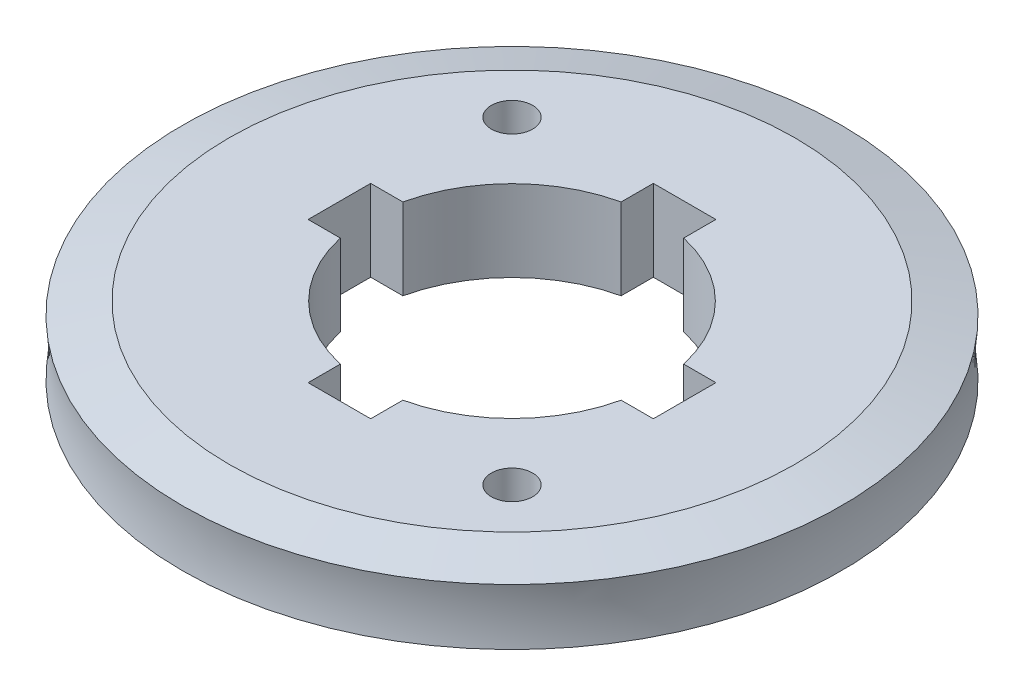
ISO-10303-21;
HEADER;
FILE_DESCRIPTION(('STEP AP214'),'2;1');
FILE_NAME('part.step','',(''),(''),'','','');
FILE_SCHEMA(('AUTOMOTIVE_DESIGN { 1 0 10303 214 1 1 1 1 }'));
ENDSEC;
DATA;
#1=APPLICATION_CONTEXT('core data for automotive mechanical design processes');
#2=APPLICATION_PROTOCOL_DEFINITION('international standard','automotive_design',2000,#1);
#3=PRODUCT_CONTEXT('',#1,'mechanical');
#4=PRODUCT('Part','Part','',(#3));
#5=PRODUCT_RELATED_PRODUCT_CATEGORY('part','',(#4));
#6=PRODUCT_DEFINITION_FORMATION('','',#4);
#7=PRODUCT_DEFINITION_CONTEXT('part definition',#1,'design');
#8=PRODUCT_DEFINITION('design','',#6,#7);
#9=PRODUCT_DEFINITION_SHAPE('','',#8);
#10=(LENGTH_UNIT() NAMED_UNIT(*) SI_UNIT(.MILLI.,.METRE.));
#11=(NAMED_UNIT(*) PLANE_ANGLE_UNIT() SI_UNIT($,.RADIAN.));
#12=(NAMED_UNIT(*) SI_UNIT($,.STERADIAN.) SOLID_ANGLE_UNIT());
#13=UNCERTAINTY_MEASURE_WITH_UNIT(LENGTH_MEASURE(1.E-05),#10,'distance_accuracy_value','');
#14=(GEOMETRIC_REPRESENTATION_CONTEXT(3) GLOBAL_UNCERTAINTY_ASSIGNED_CONTEXT((#13)) GLOBAL_UNIT_ASSIGNED_CONTEXT((#10,
#11,#12)) REPRESENTATION_CONTEXT('',''));
#15=CARTESIAN_POINT('',(0.,0.,0.));
#16=DIRECTION('',(0.,0.,1.));
#17=DIRECTION('',(1.,0.,0.));
#18=AXIS2_PLACEMENT_3D('',#15,#16,#17);
#19=CARTESIAN_POINT('',(0.,0.,0.));
#20=DIRECTION('',(0.,1.,0.));
#21=DIRECTION('',(0.,0.,1.));
#22=AXIS2_PLACEMENT_3D('',#19,#20,#21);
#23=CYLINDRICAL_SURFACE('',#22,11.5);
#24=CARTESIAN_POINT('',(0.,6.5,0.));
#25=DIRECTION('',(0.,1.,0.));
#26=DIRECTION('',(0.,0.,1.));
#27=AXIS2_PLACEMENT_3D('',#24,#25,#26);
#28=CIRCLE('',#27,11.5);
#29=CARTESIAN_POINT('',(-11.2249721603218,6.5,2.49999999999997));
#30=VERTEX_POINT('',#29);
#31=CARTESIAN_POINT('',(-2.5,6.5,11.2249721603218));
#32=VERTEX_POINT('',#31);
#33=EDGE_CURVE('E283',#30,#32,#28,.T.);
#34=ORIENTED_EDGE('',*,*,#33,.T.);
#35=DIRECTION('',(0.,1.,0.));
#36=VECTOR('',#35,1.);
#37=CARTESIAN_POINT('',(-2.5,0.,11.2249721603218));
#38=LINE('',#37,#36);
#39=CARTESIAN_POINT('',(-2.5,0.,11.2249721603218));
#40=VERTEX_POINT('',#39);
#41=EDGE_CURVE('E171',#40,#32,#38,.T.);
#42=ORIENTED_EDGE('',*,*,#41,.F.);
#43=CARTESIAN_POINT('',(0.,0.,0.));
#44=DIRECTION('',(0.,1.,0.));
#45=DIRECTION('',(0.,0.,1.));
#46=AXIS2_PLACEMENT_3D('',#43,#44,#45);
#47=CIRCLE('',#46,11.5);
#48=CARTESIAN_POINT('',(-11.2249721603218,0.,2.5));
#49=VERTEX_POINT('',#48);
#50=EDGE_CURVE('E289',#49,#40,#47,.T.);
#51=ORIENTED_EDGE('',*,*,#50,.F.);
#52=DIRECTION('',(0.,1.,0.));
#53=VECTOR('',#52,1.);
#54=CARTESIAN_POINT('',(-11.2249721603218,0.,2.5));
#55=LINE('',#54,#53);
#56=EDGE_CURVE('E239',#49,#30,#55,.T.);
#57=ORIENTED_EDGE('',*,*,#56,.T.);
#58=EDGE_LOOP('',(#34,#42,#51,#57));
#59=FACE_BOUND('',#58,.T.);
#60=ADVANCED_FACE('F41',(#59),#23,.F.);
#61=CARTESIAN_POINT('',(11.2249721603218,6.5,-2.49999999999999));
#62=VERTEX_POINT('',#61);
#63=CARTESIAN_POINT('',(2.49999999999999,6.5,-11.2249721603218));
#64=VERTEX_POINT('',#63);
#65=EDGE_CURVE('E277',#62,#64,#28,.T.);
#66=ORIENTED_EDGE('',*,*,#65,.T.);
#67=DIRECTION('',(0.,1.,0.));
#68=VECTOR('',#67,1.);
#69=CARTESIAN_POINT('',(2.49999999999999,0.,-11.2249721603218));
#70=LINE('',#69,#68);
#71=CARTESIAN_POINT('',(2.49999999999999,0.,-11.2249721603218));
#72=VERTEX_POINT('',#71);
#73=EDGE_CURVE('E212',#72,#64,#70,.T.);
#74=ORIENTED_EDGE('',*,*,#73,.F.);
#75=CARTESIAN_POINT('',(11.2249721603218,0.,-2.5));
#76=VERTEX_POINT('',#75);
#77=EDGE_CURVE('E284',#76,#72,#47,.T.);
#78=ORIENTED_EDGE('',*,*,#77,.F.);
#79=DIRECTION('',(0.,1.,0.));
#80=VECTOR('',#79,1.);
#81=CARTESIAN_POINT('',(11.2249721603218,0.,-2.5));
#82=LINE('',#81,#80);
#83=EDGE_CURVE('E268',#76,#62,#82,.T.);
#84=ORIENTED_EDGE('',*,*,#83,.T.);
#85=EDGE_LOOP('',(#66,#74,#78,#84));
#86=FACE_BOUND('',#85,.T.);
#87=ADVANCED_FACE('F312',(#86),#23,.F.);
#88=CARTESIAN_POINT('',(-2.50000000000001,0.,-11.2249721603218));
#89=VERTEX_POINT('',#88);
#90=CARTESIAN_POINT('',(-11.2249721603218,0.,-2.5));
#91=VERTEX_POINT('',#90);
#92=EDGE_CURVE('E288',#89,#91,#47,.T.);
#93=ORIENTED_EDGE('',*,*,#92,.F.);
#94=DIRECTION('',(0.,1.,0.));
#95=VECTOR('',#94,1.);
#96=CARTESIAN_POINT('',(-2.50000000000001,0.,-11.2249721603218));
#97=LINE('',#96,#95);
#98=CARTESIAN_POINT('',(-2.50000000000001,6.5,-11.2249721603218));
#99=VERTEX_POINT('',#98);
#100=EDGE_CURVE('E214',#89,#99,#97,.T.);
#101=ORIENTED_EDGE('',*,*,#100,.T.);
#102=CARTESIAN_POINT('',(-11.2249721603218,6.5,-2.5));
#103=VERTEX_POINT('',#102);
#104=EDGE_CURVE('E281',#99,#103,#28,.T.);
#105=ORIENTED_EDGE('',*,*,#104,.T.);
#106=DIRECTION('',(0.,1.,0.));
#107=VECTOR('',#106,1.);
#108=CARTESIAN_POINT('',(-11.2249721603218,0.,-2.5));
#109=LINE('',#108,#107);
#110=EDGE_CURVE('E235',#91,#103,#109,.T.);
#111=ORIENTED_EDGE('',*,*,#110,.F.);
#112=EDGE_LOOP('',(#93,#101,#105,#111));
#113=FACE_BOUND('',#112,.T.);
#114=ADVANCED_FACE('F318',(#113),#23,.F.);
#115=CARTESIAN_POINT('',(3.,0.,0.));
#116=DIRECTION('',(0.,-1.,0.));
#117=DIRECTION('',(0.,0.,-1.));
#118=AXIS2_PLACEMENT_3D('',#115,#116,#117);
#119=PLANE('',#118);
#120=DIRECTION('',(0.,0.,1.));
#121=VECTOR('',#120,1.);
#122=CARTESIAN_POINT('',(-2.5,0.,13.8));
#123=LINE('',#122,#121);
#124=CARTESIAN_POINT('',(-2.5,0.,13.8));
#125=VERTEX_POINT('',#124);
#126=EDGE_CURVE('E181',#40,#125,#123,.T.);
#127=ORIENTED_EDGE('',*,*,#126,.T.);
#128=DIRECTION('',(1.,0.,0.));
#129=VECTOR('',#128,1.);
#130=CARTESIAN_POINT('',(-2.5,0.,13.8));
#131=LINE('',#130,#129);
#132=CARTESIAN_POINT('',(2.5,0.,13.8));
#133=VERTEX_POINT('',#132);
#134=EDGE_CURVE('E161',#125,#133,#131,.T.);
#135=ORIENTED_EDGE('',*,*,#134,.T.);
#136=DIRECTION('',(0.,0.,-1.));
#137=VECTOR('',#136,1.);
#138=CARTESIAN_POINT('',(2.5,0.,13.8));
#139=LINE('',#138,#137);
#140=CARTESIAN_POINT('',(2.5,0.,11.2249721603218));
#141=VERTEX_POINT('',#140);
#142=EDGE_CURVE('E165',#133,#141,#139,.T.);
#143=ORIENTED_EDGE('',*,*,#142,.T.);
#144=CARTESIAN_POINT('',(11.2249721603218,0.,2.5));
#145=VERTEX_POINT('',#144);
#146=EDGE_CURVE('E280',#141,#145,#47,.T.);
#147=ORIENTED_EDGE('',*,*,#146,.T.);
#148=DIRECTION('',(1.,0.,0.));
#149=VECTOR('',#148,1.);
#150=CARTESIAN_POINT('',(13.8,0.,2.5));
#151=LINE('',#150,#149);
#152=CARTESIAN_POINT('',(13.8,0.,2.5));
#153=VERTEX_POINT('',#152);
#154=EDGE_CURVE('E258',#145,#153,#151,.T.);
#155=ORIENTED_EDGE('',*,*,#154,.T.);
#156=DIRECTION('',(0.,0.,-1.));
#157=VECTOR('',#156,1.);
#158=CARTESIAN_POINT('',(13.8,0.,-2.5));
#159=LINE('',#158,#157);
#160=CARTESIAN_POINT('',(13.8,0.,-2.5));
#161=VERTEX_POINT('',#160);
#162=EDGE_CURVE('E252',#153,#161,#159,.T.);
#163=ORIENTED_EDGE('',*,*,#162,.T.);
#164=DIRECTION('',(-1.,0.,0.));
#165=VECTOR('',#164,1.);
#166=CARTESIAN_POINT('',(13.8,0.,-2.5));
#167=LINE('',#166,#165);
#168=EDGE_CURVE('E255',#161,#76,#167,.T.);
#169=ORIENTED_EDGE('',*,*,#168,.T.);
#170=ORIENTED_EDGE('',*,*,#77,.T.);
#171=DIRECTION('',(0.,0.,-1.));
#172=VECTOR('',#171,1.);
#173=CARTESIAN_POINT('',(2.49999999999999,0.,-13.8));
#174=LINE('',#173,#172);
#175=CARTESIAN_POINT('',(2.49999999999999,0.,-13.8));
#176=VERTEX_POINT('',#175);
#177=EDGE_CURVE('E205',#72,#176,#174,.T.);
#178=ORIENTED_EDGE('',*,*,#177,.T.);
#179=DIRECTION('',(-1.,0.,0.));
#180=VECTOR('',#179,1.);
#181=CARTESIAN_POINT('',(-2.50000000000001,0.,-13.8));
#182=LINE('',#181,#180);
#183=CARTESIAN_POINT('',(-2.50000000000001,0.,-13.8));
#184=VERTEX_POINT('',#183);
#185=EDGE_CURVE('E199',#176,#184,#182,.T.);
#186=ORIENTED_EDGE('',*,*,#185,.T.);
#187=DIRECTION('',(0.,0.,1.));
#188=VECTOR('',#187,1.);
#189=CARTESIAN_POINT('',(-2.50000000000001,0.,-13.8));
#190=LINE('',#189,#188);
#191=EDGE_CURVE('E202',#184,#89,#190,.T.);
#192=ORIENTED_EDGE('',*,*,#191,.T.);
#193=ORIENTED_EDGE('',*,*,#92,.T.);
#194=DIRECTION('',(-1.,0.,0.));
#195=VECTOR('',#194,1.);
#196=CARTESIAN_POINT('',(-13.8,0.,-2.5));
#197=LINE('',#196,#195);
#198=CARTESIAN_POINT('',(-13.8,0.,-2.5));
#199=VERTEX_POINT('',#198);
#200=EDGE_CURVE('E225',#91,#199,#197,.T.);
#201=ORIENTED_EDGE('',*,*,#200,.T.);
#202=DIRECTION('',(0.,0.,1.));
#203=VECTOR('',#202,1.);
#204=CARTESIAN_POINT('',(-13.8,0.,-2.5));
#205=LINE('',#204,#203);
#206=CARTESIAN_POINT('',(-13.8,0.,2.5));
#207=VERTEX_POINT('',#206);
#208=EDGE_CURVE('E228',#199,#207,#205,.T.);
#209=ORIENTED_EDGE('',*,*,#208,.T.);
#210=DIRECTION('',(1.,0.,0.));
#211=VECTOR('',#210,1.);
#212=CARTESIAN_POINT('',(-13.8,0.,2.5));
#213=LINE('',#212,#211);
#214=EDGE_CURVE('E231',#207,#49,#213,.T.);
#215=ORIENTED_EDGE('',*,*,#214,.T.);
#216=ORIENTED_EDGE('',*,*,#50,.T.);
#217=EDGE_LOOP('',(#127,#135,#143,#147,#155,#163,#169,#170,#178,#186,#192,#193,#201,#209,#215,#216));
#218=FACE_BOUND('',#217,.T.);
#219=CARTESIAN_POINT('',(0.,0.,0.));
#220=DIRECTION('',(0.,-1.,0.));
#221=DIRECTION('',(0.,0.,-1.));
#222=AXIS2_PLACEMENT_3D('',#219,#220,#221);
#223=CIRCLE('',#222,14.25);
#224=CARTESIAN_POINT('',(0.,0.,-14.25));
#225=VERTEX_POINT('',#224);
#226=EDGE_CURVE('E264',#225,#225,#223,.T.);
#227=ORIENTED_EDGE('',*,*,#226,.T.);
#228=EDGE_LOOP('',(#227));
#229=FACE_BOUND('',#228,.T.);
#230=ADVANCED_FACE('F43',(#218,#229),#119,.T.);
#231=CARTESIAN_POINT('',(0.,0.,0.));
#232=DIRECTION('',(0.,1.,0.));
#233=DIRECTION('',(0.,0.,1.));
#234=AXIS2_PLACEMENT_3D('',#231,#232,#233);
#235=CONICAL_SURFACE('',#234,22.6179491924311,1.30899693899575);
#236=CARTESIAN_POINT('',(0.,0.999999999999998,0.));
#237=DIRECTION('',(0.,-1.,0.));
#238=DIRECTION('',(0.,0.,-1.));
#239=AXIS2_PLACEMENT_3D('',#236,#237,#238);
#240=CIRCLE('',#239,26.35);
#241=CARTESIAN_POINT('',(0.,0.999999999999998,-26.35));
#242=VERTEX_POINT('',#241);
#243=EDGE_CURVE('E12',#242,#242,#240,.T.);
#244=ORIENTED_EDGE('',*,*,#243,.T.);
#245=EDGE_LOOP('',(#244));
#246=FACE_BOUND('',#245,.T.);
#247=CARTESIAN_POINT('',(0.,0.3,0.));
#248=DIRECTION('',(0.,-1.,0.));
#249=DIRECTION('',(0.,0.,-1.));
#250=AXIS2_PLACEMENT_3D('',#247,#248,#249);
#251=CIRCLE('',#250,23.7375644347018);
#252=CARTESIAN_POINT('',(0.,0.3,-23.7375644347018));
#253=VERTEX_POINT('',#252);
#254=EDGE_CURVE('E45',#253,#253,#251,.F.);
#255=ORIENTED_EDGE('',*,*,#254,.T.);
#256=EDGE_LOOP('',(#255));
#257=FACE_BOUND('',#256,.T.);
#258=ADVANCED_FACE('F309',(#246,#257),#235,.T.);
#259=CARTESIAN_POINT('',(0.,3.25,0.));
#260=DIRECTION('',(0.,-1.,0.));
#261=DIRECTION('',(0.,0.,-1.));
#262=AXIS2_PLACEMENT_3D('',#259,#260,#261);
#263=TOROIDAL_SURFACE('',#262,42.1910069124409,16.);
#264=CARTESIAN_POINT('',(0.,5.49999999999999,0.));
#265=DIRECTION('',(0.,-1.,0.));
#266=DIRECTION('',(0.,0.,-1.));
#267=AXIS2_PLACEMENT_3D('',#264,#265,#266);
#268=CIRCLE('',#267,26.35);
#269=CARTESIAN_POINT('',(0.,5.49999999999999,-26.35));
#270=VERTEX_POINT('',#269);
#271=EDGE_CURVE('E50',#270,#270,#268,.T.);
#272=ORIENTED_EDGE('',*,*,#271,.T.);
#273=EDGE_LOOP('',(#272));
#274=FACE_BOUND('',#273,.T.);
#275=ORIENTED_EDGE('',*,*,#243,.F.);
#276=EDGE_LOOP('',(#275));
#277=FACE_BOUND('',#276,.T.);
#278=ADVANCED_FACE('F295',(#274,#277),#263,.F.);
#279=CARTESIAN_POINT('',(0.,5.49999999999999,0.));
#280=DIRECTION('',(0.,-1.,0.));
#281=DIRECTION('',(0.,0.,-1.));
#282=AXIS2_PLACEMENT_3D('',#279,#280,#281);
#283=CONICAL_SURFACE('',#282,26.35,1.30899693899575);
#284=CARTESIAN_POINT('',(0.,6.5,0.));
#285=DIRECTION('',(0.,-1.,0.));
#286=DIRECTION('',(0.,0.,-1.));
#287=AXIS2_PLACEMENT_3D('',#284,#285,#286);
#288=CIRCLE('',#287,22.6179491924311);
#289=CARTESIAN_POINT('',(0.,6.5,-22.6179491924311));
#290=VERTEX_POINT('',#289);
#291=EDGE_CURVE('E287',#290,#290,#288,.T.);
#292=ORIENTED_EDGE('',*,*,#291,.T.);
#293=EDGE_LOOP('',(#292));
#294=FACE_BOUND('',#293,.T.);
#295=ORIENTED_EDGE('',*,*,#271,.F.);
#296=EDGE_LOOP('',(#295));
#297=FACE_BOUND('',#296,.T.);
#298=ADVANCED_FACE('F298',(#294,#297),#283,.T.);
#299=CARTESIAN_POINT('',(22.6179491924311,6.5,0.));
#300=DIRECTION('',(0.,1.,0.));
#301=DIRECTION('',(0.,0.,1.));
#302=AXIS2_PLACEMENT_3D('',#299,#300,#301);
#303=PLANE('',#302);
#304=CARTESIAN_POINT('',(-12.7279220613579,6.5,-12.7279220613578));
#305=DIRECTION('',(0.,-1.,0.));
#306=DIRECTION('',(0.,0.,-1.));
#307=AXIS2_PLACEMENT_3D('',#304,#305,#306);
#308=CIRCLE('',#307,1.65);
#309=CARTESIAN_POINT('',(-12.7279220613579,6.5,-14.3779220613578));
#310=VERTEX_POINT('',#309);
#311=EDGE_CURVE('E517',#310,#310,#308,.T.);
#312=ORIENTED_EDGE('',*,*,#311,.T.);
#313=EDGE_LOOP('',(#312));
#314=FACE_BOUND('',#313,.T.);
#315=CARTESIAN_POINT('',(12.7279220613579,6.5,12.7279220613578));
#316=DIRECTION('',(0.,-1.,0.));
#317=DIRECTION('',(0.,0.,-1.));
#318=AXIS2_PLACEMENT_3D('',#315,#316,#317);
#319=CIRCLE('',#318,1.65);
#320=CARTESIAN_POINT('',(12.7279220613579,6.5,11.0779220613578));
#321=VERTEX_POINT('',#320);
#322=EDGE_CURVE('E175',#321,#321,#319,.T.);
#323=ORIENTED_EDGE('',*,*,#322,.T.);
#324=EDGE_LOOP('',(#323));
#325=FACE_BOUND('',#324,.T.);
#326=DIRECTION('',(0.,0.,1.));
#327=VECTOR('',#326,1.);
#328=CARTESIAN_POINT('',(-2.5,6.5,13.8));
#329=LINE('',#328,#327);
#330=CARTESIAN_POINT('',(-2.5,6.5,13.8));
#331=VERTEX_POINT('',#330);
#332=EDGE_CURVE('E168',#32,#331,#329,.T.);
#333=ORIENTED_EDGE('',*,*,#332,.F.);
#334=ORIENTED_EDGE('',*,*,#33,.F.);
#335=DIRECTION('',(1.,0.,0.));
#336=VECTOR('',#335,1.);
#337=CARTESIAN_POINT('',(-13.8,6.5,2.5));
#338=LINE('',#337,#336);
#339=CARTESIAN_POINT('',(-13.8,6.5,2.5));
#340=VERTEX_POINT('',#339);
#341=EDGE_CURVE('E223',#340,#30,#338,.T.);
#342=ORIENTED_EDGE('',*,*,#341,.F.);
#343=DIRECTION('',(0.,0.,1.));
#344=VECTOR('',#343,1.);
#345=CARTESIAN_POINT('',(-13.8,6.5,-2.5));
#346=LINE('',#345,#344);
#347=CARTESIAN_POINT('',(-13.8,6.5,-2.5));
#348=VERTEX_POINT('',#347);
#349=EDGE_CURVE('E220',#348,#340,#346,.T.);
#350=ORIENTED_EDGE('',*,*,#349,.F.);
#351=DIRECTION('',(-1.,0.,0.));
#352=VECTOR('',#351,1.);
#353=CARTESIAN_POINT('',(-13.8,6.5,-2.5));
#354=LINE('',#353,#352);
#355=EDGE_CURVE('E211',#103,#348,#354,.T.);
#356=ORIENTED_EDGE('',*,*,#355,.F.);
#357=ORIENTED_EDGE('',*,*,#104,.F.);
#358=DIRECTION('',(0.,0.,1.));
#359=VECTOR('',#358,1.);
#360=CARTESIAN_POINT('',(-2.50000000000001,6.5,-13.8));
#361=LINE('',#360,#359);
#362=CARTESIAN_POINT('',(-2.5,6.5,-13.8));
#363=VERTEX_POINT('',#362);
#364=EDGE_CURVE('E194',#363,#99,#361,.T.);
#365=ORIENTED_EDGE('',*,*,#364,.F.);
#366=DIRECTION('',(-1.,0.,0.));
#367=VECTOR('',#366,1.);
#368=CARTESIAN_POINT('',(-2.50000000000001,6.5,-13.8));
#369=LINE('',#368,#367);
#370=CARTESIAN_POINT('',(2.49999999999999,6.5,-13.8));
#371=VERTEX_POINT('',#370);
#372=EDGE_CURVE('E65',#371,#363,#369,.T.);
#373=ORIENTED_EDGE('',*,*,#372,.F.);
#374=DIRECTION('',(0.,0.,-1.));
#375=VECTOR('',#374,1.);
#376=CARTESIAN_POINT('',(2.49999999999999,6.5,-13.8));
#377=LINE('',#376,#375);
#378=EDGE_CURVE('E196',#64,#371,#377,.T.);
#379=ORIENTED_EDGE('',*,*,#378,.F.);
#380=ORIENTED_EDGE('',*,*,#65,.F.);
#381=DIRECTION('',(-1.,0.,0.));
#382=VECTOR('',#381,1.);
#383=CARTESIAN_POINT('',(13.8,6.5,-2.5));
#384=LINE('',#383,#382);
#385=CARTESIAN_POINT('',(13.8,6.5,-2.5));
#386=VERTEX_POINT('',#385);
#387=EDGE_CURVE('E247',#386,#62,#384,.T.);
#388=ORIENTED_EDGE('',*,*,#387,.F.);
#389=DIRECTION('',(0.,0.,-1.));
#390=VECTOR('',#389,1.);
#391=CARTESIAN_POINT('',(13.8,6.5,-2.5));
#392=LINE('',#391,#390);
#393=CARTESIAN_POINT('',(13.8,6.5,2.5));
#394=VERTEX_POINT('',#393);
#395=EDGE_CURVE('E238',#394,#386,#392,.T.);
#396=ORIENTED_EDGE('',*,*,#395,.F.);
#397=DIRECTION('',(1.,0.,0.));
#398=VECTOR('',#397,1.);
#399=CARTESIAN_POINT('',(13.8,6.5,2.5));
#400=LINE('',#399,#398);
#401=CARTESIAN_POINT('',(11.2249721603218,6.5,2.5));
#402=VERTEX_POINT('',#401);
#403=EDGE_CURVE('E249',#402,#394,#400,.T.);
#404=ORIENTED_EDGE('',*,*,#403,.F.);
#405=CARTESIAN_POINT('',(2.49999999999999,6.5,11.2249721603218));
#406=VERTEX_POINT('',#405);
#407=EDGE_CURVE('E282',#406,#402,#28,.T.);
#408=ORIENTED_EDGE('',*,*,#407,.F.);
#409=DIRECTION('',(0.,0.,-1.));
#410=VECTOR('',#409,1.);
#411=CARTESIAN_POINT('',(2.5,6.5,13.8));
#412=LINE('',#411,#410);
#413=CARTESIAN_POINT('',(2.5,6.5,13.8));
#414=VERTEX_POINT('',#413);
#415=EDGE_CURVE('E57',#414,#406,#412,.T.);
#416=ORIENTED_EDGE('',*,*,#415,.F.);
#417=DIRECTION('',(1.,0.,0.));
#418=VECTOR('',#417,1.);
#419=CARTESIAN_POINT('',(-2.5,6.5,13.8));
#420=LINE('',#419,#418);
#421=EDGE_CURVE('E159',#331,#414,#420,.T.);
#422=ORIENTED_EDGE('',*,*,#421,.F.);
#423=EDGE_LOOP('',(#333,#334,#342,#350,#356,#357,#365,#373,#379,#380,#388,#396,#404,#408,#416,#422));
#424=FACE_BOUND('',#423,.T.);
#425=ORIENTED_EDGE('',*,*,#291,.F.);
#426=EDGE_LOOP('',(#425));
#427=FACE_BOUND('',#426,.T.);
#428=ADVANCED_FACE('F177',(#314,#325,#424,#427),#303,.T.);
#429=ORIENTED_EDGE('',*,*,#146,.F.);
#430=DIRECTION('',(0.,1.,0.));
#431=VECTOR('',#430,1.);
#432=CARTESIAN_POINT('',(2.5,0.,11.2249721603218));
#433=LINE('',#432,#431);
#434=EDGE_CURVE('E190',#141,#406,#433,.T.);
#435=ORIENTED_EDGE('',*,*,#434,.T.);
#436=ORIENTED_EDGE('',*,*,#407,.T.);
#437=DIRECTION('',(0.,1.,0.));
#438=VECTOR('',#437,1.);
#439=CARTESIAN_POINT('',(11.2249721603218,0.,2.5));
#440=LINE('',#439,#438);
#441=EDGE_CURVE('E265',#145,#402,#440,.T.);
#442=ORIENTED_EDGE('',*,*,#441,.F.);
#443=EDGE_LOOP('',(#429,#435,#436,#442));
#444=FACE_BOUND('',#443,.T.);
#445=ADVANCED_FACE('F306',(#444),#23,.F.);
#446=CARTESIAN_POINT('',(0.,0.3,0.));
#447=DIRECTION('',(0.,-1.,0.));
#448=DIRECTION('',(0.,0.,-1.));
#449=AXIS2_PLACEMENT_3D('',#446,#447,#448);
#450=PLANE('',#449);
#451=CARTESIAN_POINT('',(-12.7279220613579,0.3,-12.7279220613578));
#452=DIRECTION('',(0.,-1.,0.));
#453=DIRECTION('',(0.,0.,-1.));
#454=AXIS2_PLACEMENT_3D('',#451,#452,#453);
#455=CIRCLE('',#454,1.65);
#456=CARTESIAN_POINT('',(-12.7279220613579,0.3,-14.3779220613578));
#457=VERTEX_POINT('',#456);
#458=EDGE_CURVE('E520',#457,#457,#455,.T.);
#459=ORIENTED_EDGE('',*,*,#458,.F.);
#460=EDGE_LOOP('',(#459));
#461=FACE_BOUND('',#460,.T.);
#462=CARTESIAN_POINT('',(12.7279220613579,0.3,12.7279220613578));
#463=DIRECTION('',(0.,-1.,0.));
#464=DIRECTION('',(0.,0.,-1.));
#465=AXIS2_PLACEMENT_3D('',#462,#463,#464);
#466=CIRCLE('',#465,1.65);
#467=CARTESIAN_POINT('',(12.7279220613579,0.3,11.0779220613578));
#468=VERTEX_POINT('',#467);
#469=EDGE_CURVE('E522',#468,#468,#466,.T.);
#470=ORIENTED_EDGE('',*,*,#469,.F.);
#471=EDGE_LOOP('',(#470));
#472=FACE_BOUND('',#471,.T.);
#473=ORIENTED_EDGE('',*,*,#254,.F.);
#474=EDGE_LOOP('',(#473));
#475=FACE_BOUND('',#474,.T.);
#476=CARTESIAN_POINT('',(0.,0.3,0.));
#477=DIRECTION('',(0.,-1.,0.));
#478=DIRECTION('',(0.,0.,-1.));
#479=AXIS2_PLACEMENT_3D('',#476,#477,#478);
#480=CIRCLE('',#479,14.25);
#481=CARTESIAN_POINT('',(0.,0.3,-14.25));
#482=VERTEX_POINT('',#481);
#483=EDGE_CURVE('E274',#482,#482,#480,.T.);
#484=ORIENTED_EDGE('',*,*,#483,.F.);
#485=EDGE_LOOP('',(#484));
#486=FACE_BOUND('',#485,.T.);
#487=ADVANCED_FACE('F322',(#461,#472,#475,#486),#450,.T.);
#488=CARTESIAN_POINT('',(0.,0.3,0.));
#489=DIRECTION('',(0.,-1.,0.));
#490=DIRECTION('',(0.,0.,-1.));
#491=AXIS2_PLACEMENT_3D('',#488,#489,#490);
#492=CYLINDRICAL_SURFACE('',#491,14.25);
#493=ORIENTED_EDGE('',*,*,#483,.T.);
#494=EDGE_LOOP('',(#493));
#495=FACE_BOUND('',#494,.T.);
#496=ORIENTED_EDGE('',*,*,#226,.F.);
#497=EDGE_LOOP('',(#496));
#498=FACE_BOUND('',#497,.T.);
#499=ADVANCED_FACE('F327',(#495,#498),#492,.T.);
#500=CARTESIAN_POINT('',(13.8,0.,-2.5));
#501=DIRECTION('',(1.,0.,0.));
#502=DIRECTION('',(0.,0.,-1.));
#503=AXIS2_PLACEMENT_3D('',#500,#501,#502);
#504=PLANE('',#503);
#505=ORIENTED_EDGE('',*,*,#395,.T.);
#506=DIRECTION('',(0.,1.,0.));
#507=VECTOR('',#506,1.);
#508=CARTESIAN_POINT('',(13.8,0.,-2.5));
#509=LINE('',#508,#507);
#510=EDGE_CURVE('E261',#161,#386,#509,.T.);
#511=ORIENTED_EDGE('',*,*,#510,.F.);
#512=ORIENTED_EDGE('',*,*,#162,.F.);
#513=DIRECTION('',(0.,1.,0.));
#514=VECTOR('',#513,1.);
#515=CARTESIAN_POINT('',(13.8,0.,2.5));
#516=LINE('',#515,#514);
#517=EDGE_CURVE('E262',#153,#394,#516,.T.);
#518=ORIENTED_EDGE('',*,*,#517,.T.);
#519=EDGE_LOOP('',(#505,#511,#512,#518));
#520=FACE_BOUND('',#519,.T.);
#521=ADVANCED_FACE('F378',(#520),#504,.F.);
#522=CARTESIAN_POINT('',(13.8,0.,2.5));
#523=DIRECTION('',(0.,0.,1.));
#524=DIRECTION('',(1.,0.,0.));
#525=AXIS2_PLACEMENT_3D('',#522,#523,#524);
#526=PLANE('',#525);
#527=ORIENTED_EDGE('',*,*,#403,.T.);
#528=ORIENTED_EDGE('',*,*,#517,.F.);
#529=ORIENTED_EDGE('',*,*,#154,.F.);
#530=ORIENTED_EDGE('',*,*,#441,.T.);
#531=EDGE_LOOP('',(#527,#528,#529,#530));
#532=FACE_BOUND('',#531,.T.);
#533=ADVANCED_FACE('F346',(#532),#526,.F.);
#534=CARTESIAN_POINT('',(13.8,0.,-2.5));
#535=DIRECTION('',(0.,0.,-1.));
#536=DIRECTION('',(-1.,0.,0.));
#537=AXIS2_PLACEMENT_3D('',#534,#535,#536);
#538=PLANE('',#537);
#539=ORIENTED_EDGE('',*,*,#387,.T.);
#540=ORIENTED_EDGE('',*,*,#83,.F.);
#541=ORIENTED_EDGE('',*,*,#168,.F.);
#542=ORIENTED_EDGE('',*,*,#510,.T.);
#543=EDGE_LOOP('',(#539,#540,#541,#542));
#544=FACE_BOUND('',#543,.T.);
#545=ADVANCED_FACE('F371',(#544),#538,.F.);
#546=CARTESIAN_POINT('',(-13.8,0.,-2.5));
#547=DIRECTION('',(0.,0.,-1.));
#548=DIRECTION('',(-1.,0.,0.));
#549=AXIS2_PLACEMENT_3D('',#546,#547,#548);
#550=PLANE('',#549);
#551=ORIENTED_EDGE('',*,*,#355,.T.);
#552=DIRECTION('',(0.,1.,0.));
#553=VECTOR('',#552,1.);
#554=CARTESIAN_POINT('',(-13.8,0.,-2.5));
#555=LINE('',#554,#553);
#556=EDGE_CURVE('E234',#199,#348,#555,.T.);
#557=ORIENTED_EDGE('',*,*,#556,.F.);
#558=ORIENTED_EDGE('',*,*,#200,.F.);
#559=ORIENTED_EDGE('',*,*,#110,.T.);
#560=EDGE_LOOP('',(#551,#557,#558,#559));
#561=FACE_BOUND('',#560,.T.);
#562=ADVANCED_FACE('F353',(#561),#550,.F.);
#563=CARTESIAN_POINT('',(-13.8,0.,2.5));
#564=DIRECTION('',(0.,0.,1.));
#565=DIRECTION('',(1.,0.,0.));
#566=AXIS2_PLACEMENT_3D('',#563,#564,#565);
#567=PLANE('',#566);
#568=ORIENTED_EDGE('',*,*,#341,.T.);
#569=ORIENTED_EDGE('',*,*,#56,.F.);
#570=ORIENTED_EDGE('',*,*,#214,.F.);
#571=DIRECTION('',(0.,1.,0.));
#572=VECTOR('',#571,1.);
#573=CARTESIAN_POINT('',(-13.8,0.,2.5));
#574=LINE('',#573,#572);
#575=EDGE_CURVE('E242',#207,#340,#574,.T.);
#576=ORIENTED_EDGE('',*,*,#575,.T.);
#577=EDGE_LOOP('',(#568,#569,#570,#576));
#578=FACE_BOUND('',#577,.T.);
#579=ADVANCED_FACE('F362',(#578),#567,.F.);
#580=CARTESIAN_POINT('',(-13.8,0.,-2.5));
#581=DIRECTION('',(-1.,0.,0.));
#582=DIRECTION('',(0.,0.,1.));
#583=AXIS2_PLACEMENT_3D('',#580,#581,#582);
#584=PLANE('',#583);
#585=ORIENTED_EDGE('',*,*,#349,.T.);
#586=ORIENTED_EDGE('',*,*,#575,.F.);
#587=ORIENTED_EDGE('',*,*,#208,.F.);
#588=ORIENTED_EDGE('',*,*,#556,.T.);
#589=EDGE_LOOP('',(#585,#586,#587,#588));
#590=FACE_BOUND('',#589,.T.);
#591=ADVANCED_FACE('F357',(#590),#584,.F.);
#592=CARTESIAN_POINT('',(-2.50000000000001,0.,-13.8));
#593=DIRECTION('',(0.,0.,-1.));
#594=DIRECTION('',(-1.,0.,0.));
#595=AXIS2_PLACEMENT_3D('',#592,#593,#594);
#596=PLANE('',#595);
#597=ORIENTED_EDGE('',*,*,#372,.T.);
#598=DIRECTION('',(0.,1.,0.));
#599=VECTOR('',#598,1.);
#600=CARTESIAN_POINT('',(-2.50000000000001,0.,-13.8));
#601=LINE('',#600,#599);
#602=EDGE_CURVE('E208',#184,#363,#601,.T.);
#603=ORIENTED_EDGE('',*,*,#602,.F.);
#604=ORIENTED_EDGE('',*,*,#185,.F.);
#605=DIRECTION('',(0.,1.,0.));
#606=VECTOR('',#605,1.);
#607=CARTESIAN_POINT('',(2.49999999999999,0.,-13.8));
#608=LINE('',#607,#606);
#609=EDGE_CURVE('E209',#176,#371,#608,.T.);
#610=ORIENTED_EDGE('',*,*,#609,.T.);
#611=EDGE_LOOP('',(#597,#603,#604,#610));
#612=FACE_BOUND('',#611,.T.);
#613=ADVANCED_FACE('F369',(#612),#596,.F.);
#614=CARTESIAN_POINT('',(2.49999999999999,0.,-13.8));
#615=DIRECTION('',(1.,0.,0.));
#616=DIRECTION('',(0.,0.,-1.));
#617=AXIS2_PLACEMENT_3D('',#614,#615,#616);
#618=PLANE('',#617);
#619=ORIENTED_EDGE('',*,*,#378,.T.);
#620=ORIENTED_EDGE('',*,*,#609,.F.);
#621=ORIENTED_EDGE('',*,*,#177,.F.);
#622=ORIENTED_EDGE('',*,*,#73,.T.);
#623=EDGE_LOOP('',(#619,#620,#621,#622));
#624=FACE_BOUND('',#623,.T.);
#625=ADVANCED_FACE('F431',(#624),#618,.F.);
#626=CARTESIAN_POINT('',(-2.50000000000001,0.,-13.8));
#627=DIRECTION('',(-1.,0.,0.));
#628=DIRECTION('',(0.,0.,1.));
#629=AXIS2_PLACEMENT_3D('',#626,#627,#628);
#630=PLANE('',#629);
#631=ORIENTED_EDGE('',*,*,#364,.T.);
#632=ORIENTED_EDGE('',*,*,#100,.F.);
#633=ORIENTED_EDGE('',*,*,#191,.F.);
#634=ORIENTED_EDGE('',*,*,#602,.T.);
#635=EDGE_LOOP('',(#631,#632,#633,#634));
#636=FACE_BOUND('',#635,.T.);
#637=ADVANCED_FACE('F439',(#636),#630,.F.);
#638=CARTESIAN_POINT('',(-2.5,0.,13.8));
#639=DIRECTION('',(-1.,0.,0.));
#640=DIRECTION('',(0.,0.,1.));
#641=AXIS2_PLACEMENT_3D('',#638,#639,#640);
#642=PLANE('',#641);
#643=ORIENTED_EDGE('',*,*,#332,.T.);
#644=DIRECTION('',(0.,1.,0.));
#645=VECTOR('',#644,1.);
#646=CARTESIAN_POINT('',(-2.5,0.,13.8));
#647=LINE('',#646,#645);
#648=EDGE_CURVE('E155',#125,#331,#647,.T.);
#649=ORIENTED_EDGE('',*,*,#648,.F.);
#650=ORIENTED_EDGE('',*,*,#126,.F.);
#651=ORIENTED_EDGE('',*,*,#41,.T.);
#652=EDGE_LOOP('',(#643,#649,#650,#651));
#653=FACE_BOUND('',#652,.T.);
#654=ADVANCED_FACE('F169',(#653),#642,.F.);
#655=CARTESIAN_POINT('',(2.5,0.,13.8));
#656=DIRECTION('',(1.,0.,0.));
#657=DIRECTION('',(0.,0.,-1.));
#658=AXIS2_PLACEMENT_3D('',#655,#656,#657);
#659=PLANE('',#658);
#660=ORIENTED_EDGE('',*,*,#415,.T.);
#661=ORIENTED_EDGE('',*,*,#434,.F.);
#662=ORIENTED_EDGE('',*,*,#142,.F.);
#663=DIRECTION('',(0.,1.,0.));
#664=VECTOR('',#663,1.);
#665=CARTESIAN_POINT('',(2.5,0.,13.8));
#666=LINE('',#665,#664);
#667=EDGE_CURVE('E164',#133,#414,#666,.T.);
#668=ORIENTED_EDGE('',*,*,#667,.T.);
#669=EDGE_LOOP('',(#660,#661,#662,#668));
#670=FACE_BOUND('',#669,.T.);
#671=ADVANCED_FACE('F457',(#670),#659,.F.);
#672=CARTESIAN_POINT('',(-2.5,0.,13.8));
#673=DIRECTION('',(0.,0.,1.));
#674=DIRECTION('',(1.,0.,0.));
#675=AXIS2_PLACEMENT_3D('',#672,#673,#674);
#676=PLANE('',#675);
#677=ORIENTED_EDGE('',*,*,#421,.T.);
#678=ORIENTED_EDGE('',*,*,#667,.F.);
#679=ORIENTED_EDGE('',*,*,#134,.F.);
#680=ORIENTED_EDGE('',*,*,#648,.T.);
#681=EDGE_LOOP('',(#677,#678,#679,#680));
#682=FACE_BOUND('',#681,.T.);
#683=ADVANCED_FACE('F157',(#682),#676,.F.);
#684=CARTESIAN_POINT('',(12.7279220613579,6.5,12.7279220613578));
#685=DIRECTION('',(0.,-1.,0.));
#686=DIRECTION('',(0.,0.,-1.));
#687=AXIS2_PLACEMENT_3D('',#684,#685,#686);
#688=CYLINDRICAL_SURFACE('',#687,1.65);
#689=ORIENTED_EDGE('',*,*,#322,.F.);
#690=EDGE_LOOP('',(#689));
#691=FACE_BOUND('',#690,.T.);
#692=ORIENTED_EDGE('',*,*,#469,.T.);
#693=EDGE_LOOP('',(#692));
#694=FACE_BOUND('',#693,.T.);
#695=ADVANCED_FACE('F474',(#691,#694),#688,.F.);
#696=CARTESIAN_POINT('',(-12.7279220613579,6.5,-12.7279220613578));
#697=DIRECTION('',(0.,-1.,0.));
#698=DIRECTION('',(0.,0.,-1.));
#699=AXIS2_PLACEMENT_3D('',#696,#697,#698);
#700=CYLINDRICAL_SURFACE('',#699,1.65);
#701=ORIENTED_EDGE('',*,*,#311,.F.);
#702=EDGE_LOOP('',(#701));
#703=FACE_BOUND('',#702,.T.);
#704=ORIENTED_EDGE('',*,*,#458,.T.);
#705=EDGE_LOOP('',(#704));
#706=FACE_BOUND('',#705,.T.);
#707=ADVANCED_FACE('F497',(#703,#706),#700,.F.);
#708=CLOSED_SHELL('',(#60,#87,#114,#230,#258,#278,#298,#428,#445,#487,#499,#521,#533,#545,#562,
#579,#591,#613,#625,#637,#654,#671,#683,#695,#707));
#709=MANIFOLD_SOLID_BREP('B2',#708);
#710=ADVANCED_BREP_SHAPE_REPRESENTATION('',(#18,#709),#14);
#711=SHAPE_DEFINITION_REPRESENTATION(#9,#710);
ENDSEC;
END-ISO-10303-21;
